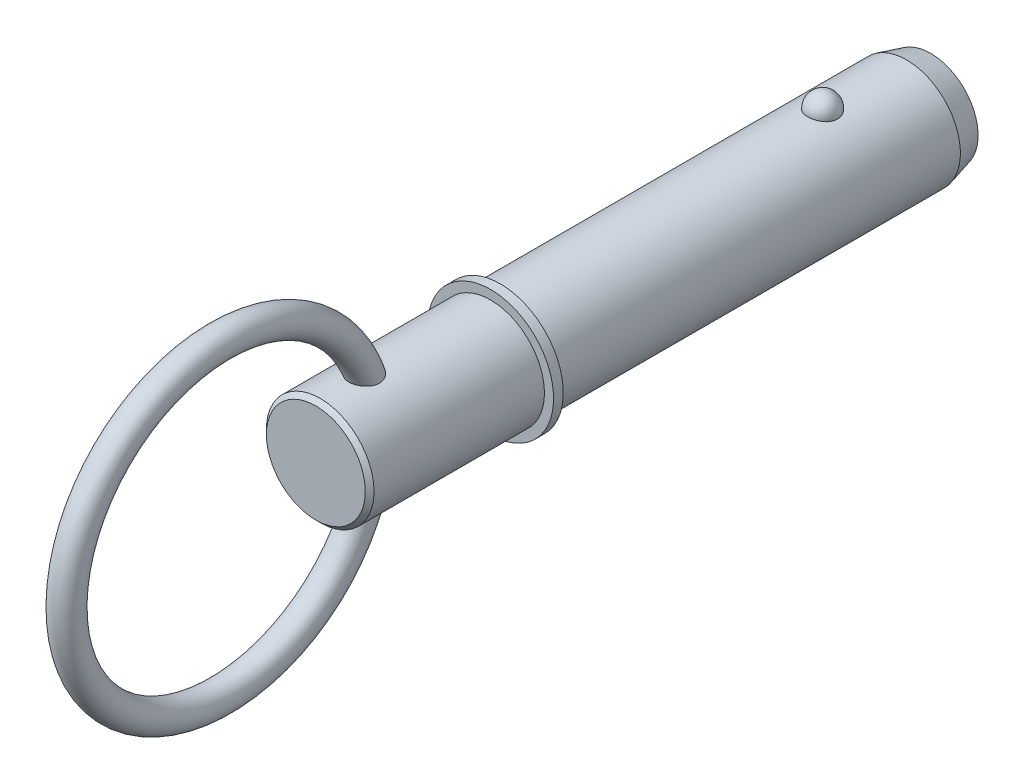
from build123d import *

# Parameters (mm, degrees)
SKETCH2_R           = 11.115
BOSS_EXTRUDE1_DEPTH = 63.5
BOSS_EXTRUDE2_START = 25.4
SKETCH3_R           = 11.115
BOSS_EXTRUDE2_DEPTH = 25.4
CHAMFER1_SIZE       = 5
CHAMFER1_SIZE2      = 1.339745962
SKETCH20_W          = 2
SKETCH20_H          = 13
SKETCH21_R          = 11.115
BOSS_EXTRUDE3_DEPTH = 38.1
CHAMFER2_SIZE       = 0.9
SKETCH24_R          = 3


with BuildPart() as part:
    # Sketch2 → Boss-Extrude1 (new body)
    with BuildSketch(Plane.XY):
        Circle(SKETCH2_R)
    extrude(amount=BOSS_EXTRUDE1_DEPTH)

    # Sketch3 → Boss-Extrude2 (add)
    with BuildSketch(Plane(origin=(0, 0, 0), x_dir=(-1, 0, 0), z_dir=(0, 0, -1)).offset(BOSS_EXTRUDE2_START)):
        Circle(SKETCH3_R)
    extrude(amount=-BOSS_EXTRUDE2_DEPTH)

    # Chamfer1
    chamfer1_edges = [part.edges().sort_by_distance(p)[0] for p in [
        (11.115, 0, -25.4),
    ]]
    chamfer1_side = [part.faces().sort_by_distance(p)[0] for p in [
        (11.115, 0, -12.7),
    ]]
    chamfer(chamfer1_edges, length=CHAMFER1_SIZE, length2=CHAMFER1_SIZE2, reference=chamfer1_side[0])

    # Sketch18 → Revolve1 (revolve)
    with BuildSketch(Plane(origin=(0, 0, 0), x_dir=(0, 0, -1), z_dir=(1, 0, 0))):
        with BuildLine():
            Line((3.07, 14.185), (3.07, 8.045))
            ThreePointArc((3.07, 8.045), (0, 11.115), (3.07, 14.185))
        make_face()
    revolve(axis=Axis((0, 14.185, -3.07), (0, -1, 0)))

    # Sketch20 → Revolve2 (revolve)
    with BuildSketch(Plane(origin=(0, 0, 0), x_dir=(0, 0, -1), z_dir=(1, 0, 0)), mode=Mode.PRIVATE) as revolve2_sk:
        with Locations((-64.5, 6.5)):
            Rectangle(SKETCH20_W, SKETCH20_H)
    revolve(revolve2_sk.sketch.rotate(Axis((0, 0, 33.728787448), (0, 0, 1)), 90), axis=Axis((0, 0, 33.728787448), (0, 0, 1)))

    # Sketch21 → Boss-Extrude3 (add)
    with BuildSketch(Plane(origin=(0, 0, 63.5), x_dir=(-1, 0, 0), z_dir=(0, 0, -1))):
        Circle(SKETCH21_R)
    extrude(amount=-BOSS_EXTRUDE3_DEPTH)

    # Chamfer2
    chamfer2_edges = [part.edges().sort_by_distance(p)[0] for p in [
        (11.115, 0, 101.6),
    ]]
    chamfer(chamfer2_edges, length=CHAMFER2_SIZE)

    # Sweep1: sweep along a path in Sketch23
    with BuildLine(Plane(origin=(0, 0, 0), x_dir=(0, 0, -1), z_dir=(1, 0, 0))) as sweep1_path:
        CenterArc((-121.35, 0), 31.75, 0, 360)
    # Sketch24 → Sweep1 (sweep)
    with BuildSketch(Plane(origin=(0, 0, 0), x_dir=(1, 0, 0), z_dir=(0, 1, 0))):
        with Locations((0, -89.6)):
            Circle(SKETCH24_R)
    sweep(path=sweep1_path.line)


solid = part.part
